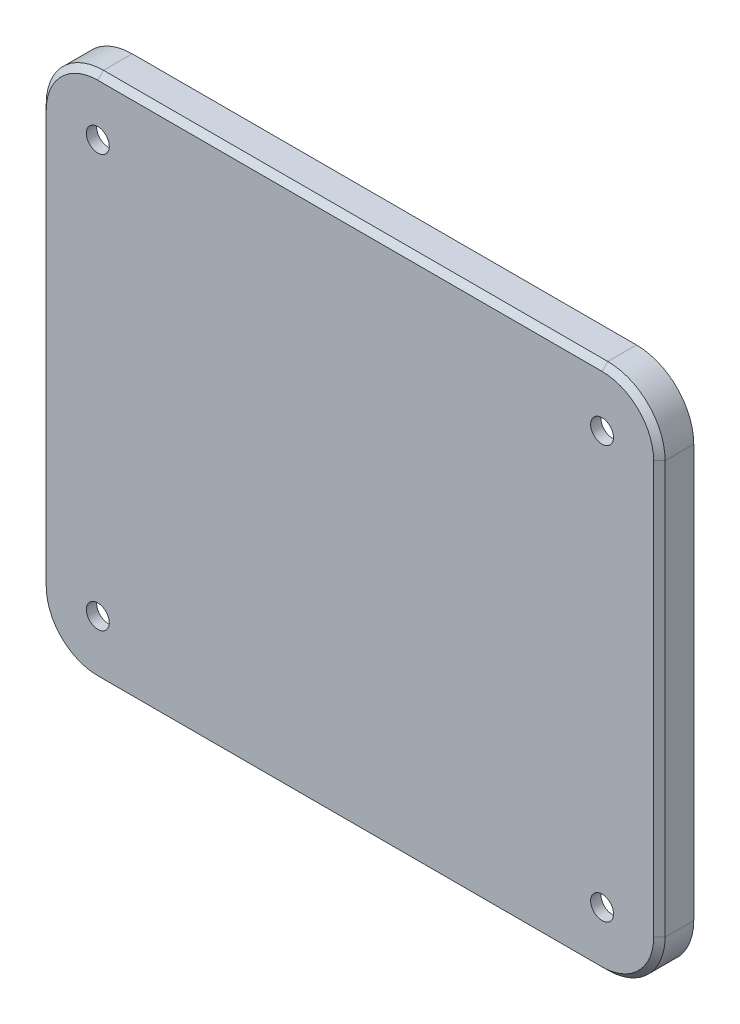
ISO-10303-21;
HEADER;
FILE_DESCRIPTION(('STEP AP214'),'2;1');
FILE_NAME('part.step','',(''),(''),'','','');
FILE_SCHEMA(('AUTOMOTIVE_DESIGN { 1 0 10303 214 1 1 1 1 }'));
ENDSEC;
DATA;
#1=APPLICATION_CONTEXT('core data for automotive mechanical design processes');
#2=APPLICATION_PROTOCOL_DEFINITION('international standard','automotive_design',2000,#1);
#3=PRODUCT_CONTEXT('',#1,'mechanical');
#4=PRODUCT('Part','Part','',(#3));
#5=PRODUCT_RELATED_PRODUCT_CATEGORY('part','',(#4));
#6=PRODUCT_DEFINITION_FORMATION('','',#4);
#7=PRODUCT_DEFINITION_CONTEXT('part definition',#1,'design');
#8=PRODUCT_DEFINITION('design','',#6,#7);
#9=PRODUCT_DEFINITION_SHAPE('','',#8);
#10=(LENGTH_UNIT() NAMED_UNIT(*) SI_UNIT(.MILLI.,.METRE.));
#11=(NAMED_UNIT(*) PLANE_ANGLE_UNIT() SI_UNIT($,.RADIAN.));
#12=(NAMED_UNIT(*) SI_UNIT($,.STERADIAN.) SOLID_ANGLE_UNIT());
#13=UNCERTAINTY_MEASURE_WITH_UNIT(LENGTH_MEASURE(1.E-05),#10,'distance_accuracy_value','');
#14=(GEOMETRIC_REPRESENTATION_CONTEXT(3) GLOBAL_UNCERTAINTY_ASSIGNED_CONTEXT((#13)) GLOBAL_UNIT_ASSIGNED_CONTEXT((#10,
#11,#12)) REPRESENTATION_CONTEXT('',''));
#15=CARTESIAN_POINT('',(0.,0.,0.));
#16=DIRECTION('',(0.,0.,1.));
#17=DIRECTION('',(1.,0.,0.));
#18=AXIS2_PLACEMENT_3D('',#15,#16,#17);
#19=CARTESIAN_POINT('',(-44.0000000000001,-36.,6.));
#20=DIRECTION('',(0.,0.,1.));
#21=DIRECTION('',(1.,0.,0.));
#22=AXIS2_PLACEMENT_3D('',#19,#20,#21);
#23=PLANE('',#22);
#24=CARTESIAN_POINT('',(-44.0000000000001,36.,6.));
#25=DIRECTION('',(0.,0.,1.));
#26=DIRECTION('',(1.,0.,0.));
#27=AXIS2_PLACEMENT_3D('',#24,#25,#26);
#28=CIRCLE('',#27,9.);
#29=CARTESIAN_POINT('',(-44.0000000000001,45.,6.));
#30=VERTEX_POINT('',#29);
#31=CARTESIAN_POINT('',(-53.0000000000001,36.,6.));
#32=VERTEX_POINT('',#31);
#33=EDGE_CURVE('E357',#30,#32,#28,.T.);
#34=ORIENTED_EDGE('',*,*,#33,.T.);
#35=DIRECTION('',(0.,-1.,0.));
#36=VECTOR('',#35,1.);
#37=CARTESIAN_POINT('',(-53.0000000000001,-36.,6.));
#38=LINE('',#37,#36);
#39=CARTESIAN_POINT('',(-53.0000000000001,-36.,6.));
#40=VERTEX_POINT('',#39);
#41=EDGE_CURVE('E361',#32,#40,#38,.T.);
#42=ORIENTED_EDGE('',*,*,#41,.T.);
#43=CARTESIAN_POINT('',(-44.0000000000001,-36.,6.));
#44=DIRECTION('',(0.,0.,1.));
#45=DIRECTION('',(1.,0.,0.));
#46=AXIS2_PLACEMENT_3D('',#43,#44,#45);
#47=CIRCLE('',#46,9.);
#48=CARTESIAN_POINT('',(-44.0000000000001,-45.,6.));
#49=VERTEX_POINT('',#48);
#50=EDGE_CURVE('E359',#40,#49,#47,.T.);
#51=ORIENTED_EDGE('',*,*,#50,.T.);
#52=DIRECTION('',(1.,0.,0.));
#53=VECTOR('',#52,1.);
#54=CARTESIAN_POINT('',(44.0000000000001,-45.,6.));
#55=LINE('',#54,#53);
#56=CARTESIAN_POINT('',(44.0000000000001,-45.,6.));
#57=VERTEX_POINT('',#56);
#58=EDGE_CURVE('E355',#49,#57,#55,.T.);
#59=ORIENTED_EDGE('',*,*,#58,.T.);
#60=CARTESIAN_POINT('',(44.0000000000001,-36.,6.));
#61=DIRECTION('',(0.,0.,1.));
#62=DIRECTION('',(1.,0.,0.));
#63=AXIS2_PLACEMENT_3D('',#60,#61,#62);
#64=CIRCLE('',#63,9.);
#65=CARTESIAN_POINT('',(53.0000000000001,-36.,6.));
#66=VERTEX_POINT('',#65);
#67=EDGE_CURVE('E351',#57,#66,#64,.T.);
#68=ORIENTED_EDGE('',*,*,#67,.T.);
#69=DIRECTION('',(0.,1.,0.));
#70=VECTOR('',#69,1.);
#71=CARTESIAN_POINT('',(53.0000000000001,36.,6.));
#72=LINE('',#71,#70);
#73=CARTESIAN_POINT('',(53.0000000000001,36.,6.));
#74=VERTEX_POINT('',#73);
#75=EDGE_CURVE('E324',#66,#74,#72,.T.);
#76=ORIENTED_EDGE('',*,*,#75,.T.);
#77=CARTESIAN_POINT('',(44.0000000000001,36.,6.));
#78=DIRECTION('',(0.,0.,1.));
#79=DIRECTION('',(1.,0.,0.));
#80=AXIS2_PLACEMENT_3D('',#77,#78,#79);
#81=CIRCLE('',#80,9.);
#82=CARTESIAN_POINT('',(44.0000000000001,45.,6.));
#83=VERTEX_POINT('',#82);
#84=EDGE_CURVE('E349',#74,#83,#81,.T.);
#85=ORIENTED_EDGE('',*,*,#84,.T.);
#86=DIRECTION('',(-1.,0.,0.));
#87=VECTOR('',#86,1.);
#88=CARTESIAN_POINT('',(-44.0000000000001,45.,6.));
#89=LINE('',#88,#87);
#90=EDGE_CURVE('E353',#83,#30,#89,.T.);
#91=ORIENTED_EDGE('',*,*,#90,.T.);
#92=EDGE_LOOP('',(#34,#42,#51,#59,#68,#76,#85,#91));
#93=FACE_BOUND('',#92,.T.);
#94=CARTESIAN_POINT('',(43.9999999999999,36.,6.));
#95=DIRECTION('',(0.,0.,1.));
#96=DIRECTION('',(1.,0.,0.));
#97=AXIS2_PLACEMENT_3D('',#94,#95,#96);
#98=CIRCLE('',#97,2.);
#99=CARTESIAN_POINT('',(45.9999999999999,36.,6.));
#100=VERTEX_POINT('',#99);
#101=EDGE_CURVE('E242',#100,#100,#98,.T.);
#102=ORIENTED_EDGE('',*,*,#101,.F.);
#103=EDGE_LOOP('',(#102));
#104=FACE_BOUND('',#103,.T.);
#105=CARTESIAN_POINT('',(-43.9999999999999,-36.,6.));
#106=DIRECTION('',(0.,0.,1.));
#107=DIRECTION('',(1.,0.,0.));
#108=AXIS2_PLACEMENT_3D('',#105,#106,#107);
#109=CIRCLE('',#108,2.);
#110=CARTESIAN_POINT('',(-41.9999999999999,-36.,6.));
#111=VERTEX_POINT('',#110);
#112=EDGE_CURVE('E248',#111,#111,#109,.T.);
#113=ORIENTED_EDGE('',*,*,#112,.F.);
#114=EDGE_LOOP('',(#113));
#115=FACE_BOUND('',#114,.T.);
#116=CARTESIAN_POINT('',(44.0000000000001,-36.,6.));
#117=DIRECTION('',(0.,0.,1.));
#118=DIRECTION('',(1.,0.,0.));
#119=AXIS2_PLACEMENT_3D('',#116,#117,#118);
#120=CIRCLE('',#119,2.);
#121=CARTESIAN_POINT('',(46.0000000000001,-36.,6.));
#122=VERTEX_POINT('',#121);
#123=EDGE_CURVE('E245',#122,#122,#120,.T.);
#124=ORIENTED_EDGE('',*,*,#123,.F.);
#125=EDGE_LOOP('',(#124));
#126=FACE_BOUND('',#125,.T.);
#127=CARTESIAN_POINT('',(-44.0000000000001,36.,6.));
#128=DIRECTION('',(0.,0.,1.));
#129=DIRECTION('',(1.,0.,0.));
#130=AXIS2_PLACEMENT_3D('',#127,#128,#129);
#131=CIRCLE('',#130,2.);
#132=CARTESIAN_POINT('',(-42.0000000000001,36.,6.));
#133=VERTEX_POINT('',#132);
#134=EDGE_CURVE('E239',#133,#133,#131,.T.);
#135=ORIENTED_EDGE('',*,*,#134,.F.);
#136=EDGE_LOOP('',(#135));
#137=FACE_BOUND('',#136,.T.);
#138=ADVANCED_FACE('F33',(#93,#104,#115,#126,#137),#23,.T.);
#139=CARTESIAN_POINT('',(-44.0000000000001,-36.,0.));
#140=DIRECTION('',(0.,0.,1.));
#141=DIRECTION('',(1.,0.,0.));
#142=AXIS2_PLACEMENT_3D('',#139,#140,#141);
#143=PLANE('',#142);
#144=DIRECTION('',(0.,-1.,0.));
#145=VECTOR('',#144,1.);
#146=CARTESIAN_POINT('',(-52.2000000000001,-36.,0.));
#147=LINE('',#146,#145);
#148=CARTESIAN_POINT('',(-52.2000000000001,36.,0.));
#149=VERTEX_POINT('',#148);
#150=CARTESIAN_POINT('',(-52.2000000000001,-36.,0.));
#151=VERTEX_POINT('',#150);
#152=EDGE_CURVE('E199',#149,#151,#147,.T.);
#153=ORIENTED_EDGE('',*,*,#152,.T.);
#154=CARTESIAN_POINT('',(-44.0000000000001,-36.,0.));
#155=DIRECTION('',(0.,0.,1.));
#156=DIRECTION('',(1.,0.,0.));
#157=AXIS2_PLACEMENT_3D('',#154,#155,#156);
#158=CIRCLE('',#157,8.20000000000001);
#159=CARTESIAN_POINT('',(-44.0000000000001,-44.2,0.));
#160=VERTEX_POINT('',#159);
#161=EDGE_CURVE('E208',#151,#160,#158,.T.);
#162=ORIENTED_EDGE('',*,*,#161,.T.);
#163=DIRECTION('',(1.,0.,0.));
#164=VECTOR('',#163,1.);
#165=CARTESIAN_POINT('',(44.0000000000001,-44.2,0.));
#166=LINE('',#165,#164);
#167=CARTESIAN_POINT('',(44.0000000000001,-44.2,0.));
#168=VERTEX_POINT('',#167);
#169=EDGE_CURVE('E215',#160,#168,#166,.T.);
#170=ORIENTED_EDGE('',*,*,#169,.T.);
#171=CARTESIAN_POINT('',(44.0000000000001,-36.,0.));
#172=DIRECTION('',(0.,0.,1.));
#173=DIRECTION('',(1.,0.,0.));
#174=AXIS2_PLACEMENT_3D('',#171,#172,#173);
#175=CIRCLE('',#174,8.2);
#176=CARTESIAN_POINT('',(52.2000000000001,-36.,0.));
#177=VERTEX_POINT('',#176);
#178=EDGE_CURVE('E235',#168,#177,#175,.T.);
#179=ORIENTED_EDGE('',*,*,#178,.T.);
#180=DIRECTION('',(0.,1.,0.));
#181=VECTOR('',#180,1.);
#182=CARTESIAN_POINT('',(52.2000000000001,-36.,0.));
#183=LINE('',#182,#181);
#184=CARTESIAN_POINT('',(52.2000000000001,36.,0.));
#185=VERTEX_POINT('',#184);
#186=EDGE_CURVE('E232',#177,#185,#183,.T.);
#187=ORIENTED_EDGE('',*,*,#186,.T.);
#188=CARTESIAN_POINT('',(44.0000000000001,36.,0.));
#189=DIRECTION('',(0.,0.,1.));
#190=DIRECTION('',(1.,0.,0.));
#191=AXIS2_PLACEMENT_3D('',#188,#189,#190);
#192=CIRCLE('',#191,8.2);
#193=CARTESIAN_POINT('',(44.0000000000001,44.2,0.));
#194=VERTEX_POINT('',#193);
#195=EDGE_CURVE('E229',#185,#194,#192,.T.);
#196=ORIENTED_EDGE('',*,*,#195,.T.);
#197=DIRECTION('',(-1.,0.,0.));
#198=VECTOR('',#197,1.);
#199=CARTESIAN_POINT('',(44.0000000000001,44.2,0.));
#200=LINE('',#199,#198);
#201=CARTESIAN_POINT('',(-44.0000000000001,44.2,0.));
#202=VERTEX_POINT('',#201);
#203=EDGE_CURVE('E224',#194,#202,#200,.T.);
#204=ORIENTED_EDGE('',*,*,#203,.T.);
#205=CARTESIAN_POINT('',(-44.0000000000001,36.,0.));
#206=DIRECTION('',(0.,0.,1.));
#207=DIRECTION('',(1.,0.,0.));
#208=AXIS2_PLACEMENT_3D('',#205,#206,#207);
#209=CIRCLE('',#208,8.2);
#210=EDGE_CURVE('E222',#202,#149,#209,.T.);
#211=ORIENTED_EDGE('',*,*,#210,.T.);
#212=EDGE_LOOP('',(#153,#162,#170,#179,#187,#196,#204,#211));
#213=FACE_BOUND('',#212,.T.);
#214=CARTESIAN_POINT('',(-44.0000000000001,-36.,0.));
#215=DIRECTION('',(0.,0.,1.));
#216=DIRECTION('',(1.,0.,0.));
#217=AXIS2_PLACEMENT_3D('',#214,#215,#216);
#218=CIRCLE('',#217,10.);
#219=CARTESIAN_POINT('',(-54.0000000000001,-36.,0.));
#220=VERTEX_POINT('',#219);
#221=CARTESIAN_POINT('',(-44.0000000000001,-46.,0.));
#222=VERTEX_POINT('',#221);
#223=EDGE_CURVE('E251',#220,#222,#218,.T.);
#224=ORIENTED_EDGE('',*,*,#223,.F.);
#225=DIRECTION('',(0.,-1.,0.));
#226=VECTOR('',#225,1.);
#227=CARTESIAN_POINT('',(-54.0000000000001,-36.,0.));
#228=LINE('',#227,#226);
#229=CARTESIAN_POINT('',(-54.0000000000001,36.,0.));
#230=VERTEX_POINT('',#229);
#231=EDGE_CURVE('E272',#230,#220,#228,.T.);
#232=ORIENTED_EDGE('',*,*,#231,.F.);
#233=CARTESIAN_POINT('',(-44.0000000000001,36.,0.));
#234=DIRECTION('',(0.,0.,1.));
#235=DIRECTION('',(1.,0.,0.));
#236=AXIS2_PLACEMENT_3D('',#233,#234,#235);
#237=CIRCLE('',#236,10.);
#238=CARTESIAN_POINT('',(-44.0000000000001,46.,0.));
#239=VERTEX_POINT('',#238);
#240=EDGE_CURVE('E269',#239,#230,#237,.T.);
#241=ORIENTED_EDGE('',*,*,#240,.F.);
#242=DIRECTION('',(-1.,0.,0.));
#243=VECTOR('',#242,1.);
#244=CARTESIAN_POINT('',(44.0000000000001,46.,0.));
#245=LINE('',#244,#243);
#246=CARTESIAN_POINT('',(44.0000000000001,46.,0.));
#247=VERTEX_POINT('',#246);
#248=EDGE_CURVE('E266',#247,#239,#245,.T.);
#249=ORIENTED_EDGE('',*,*,#248,.F.);
#250=CARTESIAN_POINT('',(44.0000000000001,36.,0.));
#251=DIRECTION('',(0.,0.,1.));
#252=DIRECTION('',(1.,0.,0.));
#253=AXIS2_PLACEMENT_3D('',#250,#251,#252);
#254=CIRCLE('',#253,10.);
#255=CARTESIAN_POINT('',(54.0000000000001,36.,0.));
#256=VERTEX_POINT('',#255);
#257=EDGE_CURVE('E263',#256,#247,#254,.T.);
#258=ORIENTED_EDGE('',*,*,#257,.F.);
#259=DIRECTION('',(0.,1.,0.));
#260=VECTOR('',#259,1.);
#261=CARTESIAN_POINT('',(54.0000000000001,-36.,0.));
#262=LINE('',#261,#260);
#263=CARTESIAN_POINT('',(54.0000000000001,-36.,0.));
#264=VERTEX_POINT('',#263);
#265=EDGE_CURVE('E260',#264,#256,#262,.T.);
#266=ORIENTED_EDGE('',*,*,#265,.F.);
#267=CARTESIAN_POINT('',(44.0000000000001,-36.,0.));
#268=DIRECTION('',(0.,0.,1.));
#269=DIRECTION('',(1.,0.,0.));
#270=AXIS2_PLACEMENT_3D('',#267,#268,#269);
#271=CIRCLE('',#270,10.);
#272=CARTESIAN_POINT('',(44.0000000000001,-46.,0.));
#273=VERTEX_POINT('',#272);
#274=EDGE_CURVE('E257',#273,#264,#271,.T.);
#275=ORIENTED_EDGE('',*,*,#274,.F.);
#276=DIRECTION('',(1.,0.,0.));
#277=VECTOR('',#276,1.);
#278=CARTESIAN_POINT('',(44.0000000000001,-46.,0.));
#279=LINE('',#278,#277);
#280=EDGE_CURVE('E254',#222,#273,#279,.T.);
#281=ORIENTED_EDGE('',*,*,#280,.F.);
#282=EDGE_LOOP('',(#224,#232,#241,#249,#258,#266,#275,#281));
#283=FACE_BOUND('',#282,.T.);
#284=ADVANCED_FACE('F218',(#213,#283),#143,.F.);
#285=CARTESIAN_POINT('',(-44.0000000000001,-36.,6.));
#286=DIRECTION('',(0.,0.,-1.));
#287=DIRECTION('',(-1.,0.,0.));
#288=AXIS2_PLACEMENT_3D('',#285,#286,#287);
#289=CYLINDRICAL_SURFACE('',#288,10.);
#290=DIRECTION('',(0.,0.,-1.));
#291=VECTOR('',#290,1.);
#292=CARTESIAN_POINT('',(-44.0000000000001,-46.,6.));
#293=LINE('',#292,#291);
#294=CARTESIAN_POINT('',(-44.0000000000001,-46.,5.));
#295=VERTEX_POINT('',#294);
#296=EDGE_CURVE('E289',#295,#222,#293,.T.);
#297=ORIENTED_EDGE('',*,*,#296,.F.);
#298=CARTESIAN_POINT('',(-44.0000000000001,-36.,5.));
#299=DIRECTION('',(0.,0.,1.));
#300=DIRECTION('',(1.,0.,0.));
#301=AXIS2_PLACEMENT_3D('',#298,#299,#300);
#302=CIRCLE('',#301,10.);
#303=CARTESIAN_POINT('',(-54.0000000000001,-36.,5.));
#304=VERTEX_POINT('',#303);
#305=EDGE_CURVE('E367',#295,#304,#302,.F.);
#306=ORIENTED_EDGE('',*,*,#305,.T.);
#307=DIRECTION('',(0.,0.,-1.));
#308=VECTOR('',#307,1.);
#309=CARTESIAN_POINT('',(-54.0000000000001,-36.,6.));
#310=LINE('',#309,#308);
#311=EDGE_CURVE('E275',#304,#220,#310,.T.);
#312=ORIENTED_EDGE('',*,*,#311,.T.);
#313=ORIENTED_EDGE('',*,*,#223,.T.);
#314=EDGE_LOOP('',(#297,#306,#312,#313));
#315=FACE_BOUND('',#314,.T.);
#316=ADVANCED_FACE('F453',(#315),#289,.T.);
#317=CARTESIAN_POINT('',(44.0000000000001,-46.,6.));
#318=DIRECTION('',(0.,1.,0.));
#319=DIRECTION('',(0.,0.,1.));
#320=AXIS2_PLACEMENT_3D('',#317,#318,#319);
#321=PLANE('',#320);
#322=DIRECTION('',(0.,0.,-1.));
#323=VECTOR('',#322,1.);
#324=CARTESIAN_POINT('',(44.0000000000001,-46.,6.));
#325=LINE('',#324,#323);
#326=CARTESIAN_POINT('',(44.0000000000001,-46.,5.));
#327=VERTEX_POINT('',#326);
#328=EDGE_CURVE('E287',#327,#273,#325,.T.);
#329=ORIENTED_EDGE('',*,*,#328,.F.);
#330=DIRECTION('',(-1.,0.,0.));
#331=VECTOR('',#330,1.);
#332=CARTESIAN_POINT('',(-44.0000000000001,-46.,5.));
#333=LINE('',#332,#331);
#334=EDGE_CURVE('E371',#327,#295,#333,.T.);
#335=ORIENTED_EDGE('',*,*,#334,.T.);
#336=ORIENTED_EDGE('',*,*,#296,.T.);
#337=ORIENTED_EDGE('',*,*,#280,.T.);
#338=EDGE_LOOP('',(#329,#335,#336,#337));
#339=FACE_BOUND('',#338,.T.);
#340=ADVANCED_FACE('F414',(#339),#321,.F.);
#341=CARTESIAN_POINT('',(44.0000000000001,-36.,6.));
#342=DIRECTION('',(0.,0.,-1.));
#343=DIRECTION('',(-1.,0.,0.));
#344=AXIS2_PLACEMENT_3D('',#341,#342,#343);
#345=CYLINDRICAL_SURFACE('',#344,10.);
#346=DIRECTION('',(0.,0.,-1.));
#347=VECTOR('',#346,1.);
#348=CARTESIAN_POINT('',(54.0000000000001,-36.,6.));
#349=LINE('',#348,#347);
#350=CARTESIAN_POINT('',(54.0000000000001,-36.,5.));
#351=VERTEX_POINT('',#350);
#352=EDGE_CURVE('E285',#351,#264,#349,.T.);
#353=ORIENTED_EDGE('',*,*,#352,.F.);
#354=CARTESIAN_POINT('',(44.0000000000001,-36.,5.));
#355=DIRECTION('',(0.,0.,1.));
#356=DIRECTION('',(1.,0.,0.));
#357=AXIS2_PLACEMENT_3D('',#354,#355,#356);
#358=CIRCLE('',#357,10.);
#359=EDGE_CURVE('E375',#351,#327,#358,.F.);
#360=ORIENTED_EDGE('',*,*,#359,.T.);
#361=ORIENTED_EDGE('',*,*,#328,.T.);
#362=ORIENTED_EDGE('',*,*,#274,.T.);
#363=EDGE_LOOP('',(#353,#360,#361,#362));
#364=FACE_BOUND('',#363,.T.);
#365=ADVANCED_FACE('F412',(#364),#345,.T.);
#366=CARTESIAN_POINT('',(54.0000000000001,-36.,6.));
#367=DIRECTION('',(-1.,0.,0.));
#368=DIRECTION('',(0.,0.,1.));
#369=AXIS2_PLACEMENT_3D('',#366,#367,#368);
#370=PLANE('',#369);
#371=DIRECTION('',(0.,0.,-1.));
#372=VECTOR('',#371,1.);
#373=CARTESIAN_POINT('',(54.0000000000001,36.,6.));
#374=LINE('',#373,#372);
#375=CARTESIAN_POINT('',(54.0000000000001,36.,5.));
#376=VERTEX_POINT('',#375);
#377=EDGE_CURVE('E283',#376,#256,#374,.T.);
#378=ORIENTED_EDGE('',*,*,#377,.F.);
#379=DIRECTION('',(0.,-1.,0.));
#380=VECTOR('',#379,1.);
#381=CARTESIAN_POINT('',(54.0000000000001,-36.,5.));
#382=LINE('',#381,#380);
#383=EDGE_CURVE('E11',#376,#351,#382,.T.);
#384=ORIENTED_EDGE('',*,*,#383,.T.);
#385=ORIENTED_EDGE('',*,*,#352,.T.);
#386=ORIENTED_EDGE('',*,*,#265,.T.);
#387=EDGE_LOOP('',(#378,#384,#385,#386));
#388=FACE_BOUND('',#387,.T.);
#389=ADVANCED_FACE('F422',(#388),#370,.F.);
#390=CARTESIAN_POINT('',(44.0000000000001,36.,6.));
#391=DIRECTION('',(0.,0.,-1.));
#392=DIRECTION('',(-1.,0.,0.));
#393=AXIS2_PLACEMENT_3D('',#390,#391,#392);
#394=CYLINDRICAL_SURFACE('',#393,10.);
#395=DIRECTION('',(0.,0.,-1.));
#396=VECTOR('',#395,1.);
#397=CARTESIAN_POINT('',(44.0000000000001,46.,6.));
#398=LINE('',#397,#396);
#399=CARTESIAN_POINT('',(44.0000000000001,46.,5.));
#400=VERTEX_POINT('',#399);
#401=EDGE_CURVE('E281',#400,#247,#398,.T.);
#402=ORIENTED_EDGE('',*,*,#401,.F.);
#403=CARTESIAN_POINT('',(44.0000000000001,36.,5.));
#404=DIRECTION('',(0.,0.,1.));
#405=DIRECTION('',(1.,0.,0.));
#406=AXIS2_PLACEMENT_3D('',#403,#404,#405);
#407=CIRCLE('',#406,10.);
#408=EDGE_CURVE('E42',#400,#376,#407,.F.);
#409=ORIENTED_EDGE('',*,*,#408,.T.);
#410=ORIENTED_EDGE('',*,*,#377,.T.);
#411=ORIENTED_EDGE('',*,*,#257,.T.);
#412=EDGE_LOOP('',(#402,#409,#410,#411));
#413=FACE_BOUND('',#412,.T.);
#414=ADVANCED_FACE('F423',(#413),#394,.T.);
#415=CARTESIAN_POINT('',(44.0000000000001,46.,6.));
#416=DIRECTION('',(0.,-1.,0.));
#417=DIRECTION('',(0.,0.,-1.));
#418=AXIS2_PLACEMENT_3D('',#415,#416,#417);
#419=PLANE('',#418);
#420=DIRECTION('',(0.,0.,-1.));
#421=VECTOR('',#420,1.);
#422=CARTESIAN_POINT('',(-44.0000000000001,46.,6.));
#423=LINE('',#422,#421);
#424=CARTESIAN_POINT('',(-44.0000000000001,46.,5.));
#425=VERTEX_POINT('',#424);
#426=EDGE_CURVE('E279',#425,#239,#423,.T.);
#427=ORIENTED_EDGE('',*,*,#426,.F.);
#428=DIRECTION('',(1.,0.,0.));
#429=VECTOR('',#428,1.);
#430=CARTESIAN_POINT('',(44.0000000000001,46.,5.));
#431=LINE('',#430,#429);
#432=EDGE_CURVE('E373',#425,#400,#431,.T.);
#433=ORIENTED_EDGE('',*,*,#432,.T.);
#434=ORIENTED_EDGE('',*,*,#401,.T.);
#435=ORIENTED_EDGE('',*,*,#248,.T.);
#436=EDGE_LOOP('',(#427,#433,#434,#435));
#437=FACE_BOUND('',#436,.T.);
#438=ADVANCED_FACE('F428',(#437),#419,.F.);
#439=CARTESIAN_POINT('',(-44.0000000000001,36.,6.));
#440=DIRECTION('',(0.,0.,-1.));
#441=DIRECTION('',(-1.,0.,0.));
#442=AXIS2_PLACEMENT_3D('',#439,#440,#441);
#443=CYLINDRICAL_SURFACE('',#442,10.);
#444=DIRECTION('',(0.,0.,-1.));
#445=VECTOR('',#444,1.);
#446=CARTESIAN_POINT('',(-54.0000000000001,36.,6.));
#447=LINE('',#446,#445);
#448=CARTESIAN_POINT('',(-54.0000000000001,36.,5.));
#449=VERTEX_POINT('',#448);
#450=EDGE_CURVE('E277',#449,#230,#447,.T.);
#451=ORIENTED_EDGE('',*,*,#450,.F.);
#452=CARTESIAN_POINT('',(-44.0000000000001,36.,5.));
#453=DIRECTION('',(0.,0.,1.));
#454=DIRECTION('',(1.,0.,0.));
#455=AXIS2_PLACEMENT_3D('',#452,#453,#454);
#456=CIRCLE('',#455,10.);
#457=EDGE_CURVE('E369',#449,#425,#456,.F.);
#458=ORIENTED_EDGE('',*,*,#457,.T.);
#459=ORIENTED_EDGE('',*,*,#426,.T.);
#460=ORIENTED_EDGE('',*,*,#240,.T.);
#461=EDGE_LOOP('',(#451,#458,#459,#460));
#462=FACE_BOUND('',#461,.T.);
#463=ADVANCED_FACE('F481',(#462),#443,.T.);
#464=CARTESIAN_POINT('',(-54.0000000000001,-36.,6.));
#465=DIRECTION('',(1.,0.,0.));
#466=DIRECTION('',(0.,1.,0.));
#467=AXIS2_PLACEMENT_3D('',#464,#465,#466);
#468=PLANE('',#467);
#469=ORIENTED_EDGE('',*,*,#311,.F.);
#470=DIRECTION('',(0.,1.,0.));
#471=VECTOR('',#470,1.);
#472=CARTESIAN_POINT('',(-54.0000000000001,36.,5.));
#473=LINE('',#472,#471);
#474=EDGE_CURVE('E364',#304,#449,#473,.T.);
#475=ORIENTED_EDGE('',*,*,#474,.T.);
#476=ORIENTED_EDGE('',*,*,#450,.T.);
#477=ORIENTED_EDGE('',*,*,#231,.T.);
#478=EDGE_LOOP('',(#469,#475,#476,#477));
#479=FACE_BOUND('',#478,.T.);
#480=ADVANCED_FACE('F456',(#479),#468,.F.);
#481=CARTESIAN_POINT('',(-43.9999999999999,-36.,6.));
#482=DIRECTION('',(0.,0.,-1.));
#483=DIRECTION('',(-1.,0.,0.));
#484=AXIS2_PLACEMENT_3D('',#481,#482,#483);
#485=CYLINDRICAL_SURFACE('',#484,2.);
#486=CARTESIAN_POINT('',(-43.9999999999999,-36.,4.2));
#487=DIRECTION('',(0.,0.,1.));
#488=DIRECTION('',(1.,0.,0.));
#489=AXIS2_PLACEMENT_3D('',#486,#487,#488);
#490=CIRCLE('',#489,2.);
#491=CARTESIAN_POINT('',(-41.9999999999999,-36.,4.2));
#492=VERTEX_POINT('',#491);
#493=EDGE_CURVE('E216',#492,#492,#490,.T.);
#494=ORIENTED_EDGE('',*,*,#493,.F.);
#495=EDGE_LOOP('',(#494));
#496=FACE_BOUND('',#495,.T.);
#497=ORIENTED_EDGE('',*,*,#112,.T.);
#498=EDGE_LOOP('',(#497));
#499=FACE_BOUND('',#498,.T.);
#500=ADVANCED_FACE('F476',(#496,#499),#485,.F.);
#501=CARTESIAN_POINT('',(44.0000000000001,-36.,6.));
#502=DIRECTION('',(0.,0.,-1.));
#503=DIRECTION('',(-1.,0.,0.));
#504=AXIS2_PLACEMENT_3D('',#501,#502,#503);
#505=CYLINDRICAL_SURFACE('',#504,2.);
#506=CARTESIAN_POINT('',(44.0000000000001,-36.,4.2));
#507=DIRECTION('',(0.,0.,1.));
#508=DIRECTION('',(1.,0.,0.));
#509=AXIS2_PLACEMENT_3D('',#506,#507,#508);
#510=CIRCLE('',#509,2.);
#511=CARTESIAN_POINT('',(46.0000000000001,-36.,4.2));
#512=VERTEX_POINT('',#511);
#513=EDGE_CURVE('E572',#512,#512,#510,.T.);
#514=ORIENTED_EDGE('',*,*,#513,.F.);
#515=EDGE_LOOP('',(#514));
#516=FACE_BOUND('',#515,.T.);
#517=ORIENTED_EDGE('',*,*,#123,.T.);
#518=EDGE_LOOP('',(#517));
#519=FACE_BOUND('',#518,.T.);
#520=ADVANCED_FACE('F592',(#516,#519),#505,.F.);
#521=CARTESIAN_POINT('',(43.9999999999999,36.,6.));
#522=DIRECTION('',(0.,0.,-1.));
#523=DIRECTION('',(-1.,0.,0.));
#524=AXIS2_PLACEMENT_3D('',#521,#522,#523);
#525=CYLINDRICAL_SURFACE('',#524,2.);
#526=CARTESIAN_POINT('',(43.9999999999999,36.,4.2));
#527=DIRECTION('',(0.,0.,1.));
#528=DIRECTION('',(1.,0.,0.));
#529=AXIS2_PLACEMENT_3D('',#526,#527,#528);
#530=CIRCLE('',#529,2.);
#531=CARTESIAN_POINT('',(45.9999999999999,36.,4.2));
#532=VERTEX_POINT('',#531);
#533=EDGE_CURVE('E569',#532,#532,#530,.T.);
#534=ORIENTED_EDGE('',*,*,#533,.F.);
#535=EDGE_LOOP('',(#534));
#536=FACE_BOUND('',#535,.T.);
#537=ORIENTED_EDGE('',*,*,#101,.T.);
#538=EDGE_LOOP('',(#537));
#539=FACE_BOUND('',#538,.T.);
#540=ADVANCED_FACE('F583',(#536,#539),#525,.F.);
#541=CARTESIAN_POINT('',(-44.0000000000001,36.,6.));
#542=DIRECTION('',(0.,0.,-1.));
#543=DIRECTION('',(-1.,0.,0.));
#544=AXIS2_PLACEMENT_3D('',#541,#542,#543);
#545=CYLINDRICAL_SURFACE('',#544,2.);
#546=CARTESIAN_POINT('',(-44.0000000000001,36.,4.2));
#547=DIRECTION('',(0.,0.,1.));
#548=DIRECTION('',(1.,0.,0.));
#549=AXIS2_PLACEMENT_3D('',#546,#547,#548);
#550=CIRCLE('',#549,2.);
#551=CARTESIAN_POINT('',(-42.0000000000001,36.,4.2));
#552=VERTEX_POINT('',#551);
#553=EDGE_CURVE('E347',#552,#552,#550,.T.);
#554=ORIENTED_EDGE('',*,*,#553,.F.);
#555=EDGE_LOOP('',(#554));
#556=FACE_BOUND('',#555,.T.);
#557=ORIENTED_EDGE('',*,*,#134,.T.);
#558=EDGE_LOOP('',(#557));
#559=FACE_BOUND('',#558,.T.);
#560=ADVANCED_FACE('F580',(#556,#559),#545,.F.);
#561=CARTESIAN_POINT('',(-44.0000000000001,-36.,4.2));
#562=DIRECTION('',(0.,0.,1.));
#563=DIRECTION('',(1.,0.,0.));
#564=AXIS2_PLACEMENT_3D('',#561,#562,#563);
#565=PLANE('',#564);
#566=DIRECTION('',(0.,-1.,0.));
#567=VECTOR('',#566,1.);
#568=CARTESIAN_POINT('',(-50.4000000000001,-36.,4.2));
#569=LINE('',#568,#567);
#570=CARTESIAN_POINT('',(-50.4000000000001,-36.,4.2));
#571=VERTEX_POINT('',#570);
#572=CARTESIAN_POINT('',(-50.4000000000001,36.,4.2));
#573=VERTEX_POINT('',#572);
#574=EDGE_CURVE('E294',#571,#573,#569,.F.);
#575=ORIENTED_EDGE('',*,*,#574,.T.);
#576=CARTESIAN_POINT('',(-44.0000000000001,36.,4.2));
#577=DIRECTION('',(0.,0.,1.));
#578=DIRECTION('',(1.,0.,0.));
#579=AXIS2_PLACEMENT_3D('',#576,#577,#578);
#580=CIRCLE('',#579,6.4);
#581=CARTESIAN_POINT('',(-44.0000000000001,42.4,4.2));
#582=VERTEX_POINT('',#581);
#583=EDGE_CURVE('E308',#573,#582,#580,.F.);
#584=ORIENTED_EDGE('',*,*,#583,.T.);
#585=DIRECTION('',(-1.,0.,0.));
#586=VECTOR('',#585,1.);
#587=CARTESIAN_POINT('',(-44.0000000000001,42.4,4.2));
#588=LINE('',#587,#586);
#589=CARTESIAN_POINT('',(44.0000000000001,42.4,4.2));
#590=VERTEX_POINT('',#589);
#591=EDGE_CURVE('E306',#582,#590,#588,.F.);
#592=ORIENTED_EDGE('',*,*,#591,.T.);
#593=CARTESIAN_POINT('',(44.0000000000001,36.,4.2));
#594=DIRECTION('',(0.,0.,1.));
#595=DIRECTION('',(1.,0.,0.));
#596=AXIS2_PLACEMENT_3D('',#593,#594,#595);
#597=CIRCLE('',#596,6.4);
#598=CARTESIAN_POINT('',(50.4000000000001,36.,4.2));
#599=VERTEX_POINT('',#598);
#600=EDGE_CURVE('E304',#590,#599,#597,.F.);
#601=ORIENTED_EDGE('',*,*,#600,.T.);
#602=DIRECTION('',(0.,1.,0.));
#603=VECTOR('',#602,1.);
#604=CARTESIAN_POINT('',(50.4000000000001,-36.,4.2));
#605=LINE('',#604,#603);
#606=CARTESIAN_POINT('',(50.4000000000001,-36.,4.2));
#607=VERTEX_POINT('',#606);
#608=EDGE_CURVE('E302',#599,#607,#605,.F.);
#609=ORIENTED_EDGE('',*,*,#608,.T.);
#610=CARTESIAN_POINT('',(44.0000000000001,-36.,4.2));
#611=DIRECTION('',(0.,0.,1.));
#612=DIRECTION('',(1.,0.,0.));
#613=AXIS2_PLACEMENT_3D('',#610,#611,#612);
#614=CIRCLE('',#613,6.4);
#615=CARTESIAN_POINT('',(44.0000000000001,-42.4,4.2));
#616=VERTEX_POINT('',#615);
#617=EDGE_CURVE('E300',#607,#616,#614,.F.);
#618=ORIENTED_EDGE('',*,*,#617,.T.);
#619=DIRECTION('',(1.,0.,0.));
#620=VECTOR('',#619,1.);
#621=CARTESIAN_POINT('',(-44.0000000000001,-42.4,4.2));
#622=LINE('',#621,#620);
#623=CARTESIAN_POINT('',(-44.0000000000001,-42.4,4.2));
#624=VERTEX_POINT('',#623);
#625=EDGE_CURVE('E298',#616,#624,#622,.F.);
#626=ORIENTED_EDGE('',*,*,#625,.T.);
#627=CARTESIAN_POINT('',(-44.0000000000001,-36.,4.2));
#628=DIRECTION('',(0.,0.,1.));
#629=DIRECTION('',(1.,0.,0.));
#630=AXIS2_PLACEMENT_3D('',#627,#628,#629);
#631=CIRCLE('',#630,6.40000000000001);
#632=EDGE_CURVE('E296',#624,#571,#631,.F.);
#633=ORIENTED_EDGE('',*,*,#632,.T.);
#634=EDGE_LOOP('',(#575,#584,#592,#601,#609,#618,#626,#633));
#635=FACE_BOUND('',#634,.T.);
#636=ORIENTED_EDGE('',*,*,#533,.T.);
#637=EDGE_LOOP('',(#636));
#638=FACE_BOUND('',#637,.T.);
#639=ORIENTED_EDGE('',*,*,#493,.T.);
#640=EDGE_LOOP('',(#639));
#641=FACE_BOUND('',#640,.T.);
#642=ORIENTED_EDGE('',*,*,#513,.T.);
#643=EDGE_LOOP('',(#642));
#644=FACE_BOUND('',#643,.T.);
#645=ORIENTED_EDGE('',*,*,#553,.T.);
#646=EDGE_LOOP('',(#645));
#647=FACE_BOUND('',#646,.T.);
#648=ADVANCED_FACE('F540',(#635,#638,#641,#644,#647),#565,.F.);
#649=CARTESIAN_POINT('',(-44.0000000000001,-36.,6.));
#650=DIRECTION('',(0.,0.,-1.));
#651=DIRECTION('',(-1.,0.,0.));
#652=AXIS2_PLACEMENT_3D('',#649,#650,#651);
#653=CYLINDRICAL_SURFACE('',#652,8.20000000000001);
#654=DIRECTION('',(0.,0.,-1.));
#655=VECTOR('',#654,1.);
#656=CARTESIAN_POINT('',(-52.2000000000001,-36.,6.));
#657=LINE('',#656,#655);
#658=CARTESIAN_POINT('',(-52.2000000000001,-36.,2.4));
#659=VERTEX_POINT('',#658);
#660=EDGE_CURVE('E194',#659,#151,#657,.T.);
#661=ORIENTED_EDGE('',*,*,#660,.F.);
#662=CARTESIAN_POINT('',(-44.0000000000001,-36.,2.4));
#663=DIRECTION('',(0.,0.,1.));
#664=DIRECTION('',(1.,0.,0.));
#665=AXIS2_PLACEMENT_3D('',#662,#663,#664);
#666=CIRCLE('',#665,8.20000000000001);
#667=CARTESIAN_POINT('',(-44.0000000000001,-44.2,2.4));
#668=VERTEX_POINT('',#667);
#669=EDGE_CURVE('E321',#659,#668,#666,.T.);
#670=ORIENTED_EDGE('',*,*,#669,.T.);
#671=DIRECTION('',(0.,0.,1.));
#672=VECTOR('',#671,1.);
#673=CARTESIAN_POINT('',(-44.0000000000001,-44.2,6.));
#674=LINE('',#673,#672);
#675=EDGE_CURVE('E211',#668,#160,#674,.F.);
#676=ORIENTED_EDGE('',*,*,#675,.T.);
#677=ORIENTED_EDGE('',*,*,#161,.F.);
#678=EDGE_LOOP('',(#661,#670,#676,#677));
#679=FACE_BOUND('',#678,.T.);
#680=ADVANCED_FACE('F209',(#679),#653,.F.);
#681=CARTESIAN_POINT('',(44.0000000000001,-44.2,6.));
#682=DIRECTION('',(0.,1.,0.));
#683=DIRECTION('',(0.,0.,1.));
#684=AXIS2_PLACEMENT_3D('',#681,#682,#683);
#685=PLANE('',#684);
#686=ORIENTED_EDGE('',*,*,#675,.F.);
#687=DIRECTION('',(1.,0.,0.));
#688=VECTOR('',#687,1.);
#689=CARTESIAN_POINT('',(44.0000000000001,-44.2,2.4));
#690=LINE('',#689,#688);
#691=CARTESIAN_POINT('',(44.0000000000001,-44.2,2.4));
#692=VERTEX_POINT('',#691);
#693=EDGE_CURVE('E319',#668,#692,#690,.T.);
#694=ORIENTED_EDGE('',*,*,#693,.T.);
#695=DIRECTION('',(0.,0.,-1.));
#696=VECTOR('',#695,1.);
#697=CARTESIAN_POINT('',(44.0000000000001,-44.2,6.));
#698=LINE('',#697,#696);
#699=EDGE_CURVE('E854',#692,#168,#698,.T.);
#700=ORIENTED_EDGE('',*,*,#699,.T.);
#701=ORIENTED_EDGE('',*,*,#169,.F.);
#702=EDGE_LOOP('',(#686,#694,#700,#701));
#703=FACE_BOUND('',#702,.T.);
#704=ADVANCED_FACE('F809',(#703),#685,.T.);
#705=CARTESIAN_POINT('',(44.0000000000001,-36.,6.));
#706=DIRECTION('',(0.,0.,-1.));
#707=DIRECTION('',(-1.,0.,0.));
#708=AXIS2_PLACEMENT_3D('',#705,#706,#707);
#709=CYLINDRICAL_SURFACE('',#708,8.2);
#710=ORIENTED_EDGE('',*,*,#699,.F.);
#711=CARTESIAN_POINT('',(44.0000000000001,-36.,2.4));
#712=DIRECTION('',(0.,0.,1.));
#713=DIRECTION('',(1.,0.,0.));
#714=AXIS2_PLACEMENT_3D('',#711,#712,#713);
#715=CIRCLE('',#714,8.2);
#716=CARTESIAN_POINT('',(52.2000000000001,-36.,2.4));
#717=VERTEX_POINT('',#716);
#718=EDGE_CURVE('E317',#692,#717,#715,.T.);
#719=ORIENTED_EDGE('',*,*,#718,.T.);
#720=DIRECTION('',(0.,0.,1.));
#721=VECTOR('',#720,1.);
#722=CARTESIAN_POINT('',(52.2000000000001,-36.,6.));
#723=LINE('',#722,#721);
#724=EDGE_CURVE('E563',#717,#177,#723,.F.);
#725=ORIENTED_EDGE('',*,*,#724,.T.);
#726=ORIENTED_EDGE('',*,*,#178,.F.);
#727=EDGE_LOOP('',(#710,#719,#725,#726));
#728=FACE_BOUND('',#727,.T.);
#729=ADVANCED_FACE('F799',(#728),#709,.F.);
#730=CARTESIAN_POINT('',(52.2000000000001,-36.,6.));
#731=DIRECTION('',(-1.,0.,0.));
#732=DIRECTION('',(0.,0.,1.));
#733=AXIS2_PLACEMENT_3D('',#730,#731,#732);
#734=PLANE('',#733);
#735=ORIENTED_EDGE('',*,*,#724,.F.);
#736=DIRECTION('',(0.,1.,0.));
#737=VECTOR('',#736,1.);
#738=CARTESIAN_POINT('',(52.2000000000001,-36.,2.4));
#739=LINE('',#738,#737);
#740=CARTESIAN_POINT('',(52.2000000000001,36.,2.4));
#741=VERTEX_POINT('',#740);
#742=EDGE_CURVE('E315',#717,#741,#739,.T.);
#743=ORIENTED_EDGE('',*,*,#742,.T.);
#744=DIRECTION('',(0.,0.,-1.));
#745=VECTOR('',#744,1.);
#746=CARTESIAN_POINT('',(52.2000000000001,36.,6.));
#747=LINE('',#746,#745);
#748=EDGE_CURVE('E557',#741,#185,#747,.T.);
#749=ORIENTED_EDGE('',*,*,#748,.T.);
#750=ORIENTED_EDGE('',*,*,#186,.F.);
#751=EDGE_LOOP('',(#735,#743,#749,#750));
#752=FACE_BOUND('',#751,.T.);
#753=ADVANCED_FACE('F790',(#752),#734,.T.);
#754=CARTESIAN_POINT('',(44.0000000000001,36.,6.));
#755=DIRECTION('',(0.,0.,-1.));
#756=DIRECTION('',(-1.,0.,0.));
#757=AXIS2_PLACEMENT_3D('',#754,#755,#756);
#758=CYLINDRICAL_SURFACE('',#757,8.2);
#759=ORIENTED_EDGE('',*,*,#748,.F.);
#760=CARTESIAN_POINT('',(44.0000000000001,36.,2.4));
#761=DIRECTION('',(0.,0.,1.));
#762=DIRECTION('',(1.,0.,0.));
#763=AXIS2_PLACEMENT_3D('',#760,#761,#762);
#764=CIRCLE('',#763,8.2);
#765=CARTESIAN_POINT('',(44.0000000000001,44.2,2.4));
#766=VERTEX_POINT('',#765);
#767=EDGE_CURVE('E313',#741,#766,#764,.T.);
#768=ORIENTED_EDGE('',*,*,#767,.T.);
#769=DIRECTION('',(0.,0.,-1.));
#770=VECTOR('',#769,1.);
#771=CARTESIAN_POINT('',(44.0000000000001,44.2,6.));
#772=LINE('',#771,#770);
#773=EDGE_CURVE('E555',#766,#194,#772,.T.);
#774=ORIENTED_EDGE('',*,*,#773,.T.);
#775=ORIENTED_EDGE('',*,*,#195,.F.);
#776=EDGE_LOOP('',(#759,#768,#774,#775));
#777=FACE_BOUND('',#776,.T.);
#778=ADVANCED_FACE('F553',(#777),#758,.F.);
#779=CARTESIAN_POINT('',(44.0000000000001,44.2,6.));
#780=DIRECTION('',(0.,-1.,0.));
#781=DIRECTION('',(0.,0.,-1.));
#782=AXIS2_PLACEMENT_3D('',#779,#780,#781);
#783=PLANE('',#782);
#784=ORIENTED_EDGE('',*,*,#773,.F.);
#785=DIRECTION('',(-1.,0.,0.));
#786=VECTOR('',#785,1.);
#787=CARTESIAN_POINT('',(44.0000000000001,44.2,2.4));
#788=LINE('',#787,#786);
#789=CARTESIAN_POINT('',(-44.0000000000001,44.2,2.4));
#790=VERTEX_POINT('',#789);
#791=EDGE_CURVE('E311',#766,#790,#788,.T.);
#792=ORIENTED_EDGE('',*,*,#791,.T.);
#793=DIRECTION('',(0.,0.,-1.));
#794=VECTOR('',#793,1.);
#795=CARTESIAN_POINT('',(-44.0000000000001,44.2,6.));
#796=LINE('',#795,#794);
#797=EDGE_CURVE('E561',#790,#202,#796,.T.);
#798=ORIENTED_EDGE('',*,*,#797,.T.);
#799=ORIENTED_EDGE('',*,*,#203,.F.);
#800=EDGE_LOOP('',(#784,#792,#798,#799));
#801=FACE_BOUND('',#800,.T.);
#802=ADVANCED_FACE('F559',(#801),#783,.T.);
#803=CARTESIAN_POINT('',(-44.0000000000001,36.,6.));
#804=DIRECTION('',(0.,0.,-1.));
#805=DIRECTION('',(-1.,0.,0.));
#806=AXIS2_PLACEMENT_3D('',#803,#804,#805);
#807=CYLINDRICAL_SURFACE('',#806,8.2);
#808=ORIENTED_EDGE('',*,*,#797,.F.);
#809=CARTESIAN_POINT('',(-44.0000000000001,36.,2.4));
#810=DIRECTION('',(0.,0.,1.));
#811=DIRECTION('',(1.,0.,0.));
#812=AXIS2_PLACEMENT_3D('',#809,#810,#811);
#813=CIRCLE('',#812,8.2);
#814=CARTESIAN_POINT('',(-52.2000000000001,36.,2.4));
#815=VERTEX_POINT('',#814);
#816=EDGE_CURVE('E291',#790,#815,#813,.T.);
#817=ORIENTED_EDGE('',*,*,#816,.T.);
#818=DIRECTION('',(0.,0.,1.));
#819=VECTOR('',#818,1.);
#820=CARTESIAN_POINT('',(-52.2000000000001,36.,6.));
#821=LINE('',#820,#819);
#822=EDGE_CURVE('E205',#815,#149,#821,.F.);
#823=ORIENTED_EDGE('',*,*,#822,.T.);
#824=ORIENTED_EDGE('',*,*,#210,.F.);
#825=EDGE_LOOP('',(#808,#817,#823,#824));
#826=FACE_BOUND('',#825,.T.);
#827=ADVANCED_FACE('F529',(#826),#807,.F.);
#828=CARTESIAN_POINT('',(-52.2000000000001,-36.,6.));
#829=DIRECTION('',(1.,0.,0.));
#830=DIRECTION('',(0.,1.,0.));
#831=AXIS2_PLACEMENT_3D('',#828,#829,#830);
#832=PLANE('',#831);
#833=ORIENTED_EDGE('',*,*,#822,.F.);
#834=DIRECTION('',(0.,-1.,0.));
#835=VECTOR('',#834,1.);
#836=CARTESIAN_POINT('',(-52.2000000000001,-36.,2.4));
#837=LINE('',#836,#835);
#838=EDGE_CURVE('E202',#815,#659,#837,.T.);
#839=ORIENTED_EDGE('',*,*,#838,.T.);
#840=ORIENTED_EDGE('',*,*,#660,.T.);
#841=ORIENTED_EDGE('',*,*,#152,.F.);
#842=EDGE_LOOP('',(#833,#839,#840,#841));
#843=FACE_BOUND('',#842,.T.);
#844=ADVANCED_FACE('F197',(#843),#832,.T.);
#845=CARTESIAN_POINT('',(44.0000000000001,-36.,2.4));
#846=DIRECTION('',(0.,0.,1.));
#847=DIRECTION('',(1.,0.,0.));
#848=AXIS2_PLACEMENT_3D('',#845,#846,#847);
#849=TOROIDAL_SURFACE('',#848,6.4,1.8);
#850=CARTESIAN_POINT('',(44.0000000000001,-42.4,2.4));
#851=DIRECTION('',(1.,0.,0.));
#852=DIRECTION('',(0.,0.,-1.));
#853=AXIS2_PLACEMENT_3D('',#850,#851,#852);
#854=CIRCLE('',#853,1.8);
#855=EDGE_CURVE('E341',#616,#692,#854,.T.);
#856=ORIENTED_EDGE('',*,*,#855,.F.);
#857=ORIENTED_EDGE('',*,*,#617,.F.);
#858=CARTESIAN_POINT('',(50.4000000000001,-36.,2.4));
#859=DIRECTION('',(0.,-1.,0.));
#860=DIRECTION('',(0.,0.,-1.));
#861=AXIS2_PLACEMENT_3D('',#858,#859,#860);
#862=CIRCLE('',#861,1.8);
#863=EDGE_CURVE('E344',#717,#607,#862,.T.);
#864=ORIENTED_EDGE('',*,*,#863,.F.);
#865=ORIENTED_EDGE('',*,*,#718,.F.);
#866=EDGE_LOOP('',(#856,#857,#864,#865));
#867=FACE_BOUND('',#866,.T.);
#868=ADVANCED_FACE('F522',(#867),#849,.F.);
#869=CARTESIAN_POINT('',(50.4000000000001,-36.,2.4));
#870=DIRECTION('',(0.,1.,0.));
#871=DIRECTION('',(0.,0.,1.));
#872=AXIS2_PLACEMENT_3D('',#869,#870,#871);
#873=CYLINDRICAL_SURFACE('',#872,1.8);
#874=ORIENTED_EDGE('',*,*,#863,.T.);
#875=ORIENTED_EDGE('',*,*,#608,.F.);
#876=CARTESIAN_POINT('',(50.4000000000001,36.,2.4));
#877=DIRECTION('',(0.,-1.,0.));
#878=DIRECTION('',(0.,0.,-1.));
#879=AXIS2_PLACEMENT_3D('',#876,#877,#878);
#880=CIRCLE('',#879,1.8);
#881=EDGE_CURVE('E338',#741,#599,#880,.T.);
#882=ORIENTED_EDGE('',*,*,#881,.F.);
#883=ORIENTED_EDGE('',*,*,#742,.F.);
#884=EDGE_LOOP('',(#874,#875,#882,#883));
#885=FACE_BOUND('',#884,.T.);
#886=ADVANCED_FACE('F519',(#885),#873,.F.);
#887=CARTESIAN_POINT('',(44.0000000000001,-42.4,2.4));
#888=DIRECTION('',(1.,0.,0.));
#889=DIRECTION('',(0.,0.,-1.));
#890=AXIS2_PLACEMENT_3D('',#887,#888,#889);
#891=CYLINDRICAL_SURFACE('',#890,1.8);
#892=ORIENTED_EDGE('',*,*,#855,.T.);
#893=ORIENTED_EDGE('',*,*,#693,.F.);
#894=CARTESIAN_POINT('',(-44.0000000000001,-42.4,2.4));
#895=DIRECTION('',(1.,0.,0.));
#896=DIRECTION('',(0.,0.,-1.));
#897=AXIS2_PLACEMENT_3D('',#894,#895,#896);
#898=CIRCLE('',#897,1.8);
#899=EDGE_CURVE('E335',#624,#668,#898,.T.);
#900=ORIENTED_EDGE('',*,*,#899,.F.);
#901=ORIENTED_EDGE('',*,*,#625,.F.);
#902=EDGE_LOOP('',(#892,#893,#900,#901));
#903=FACE_BOUND('',#902,.T.);
#904=ADVANCED_FACE('F515',(#903),#891,.F.);
#905=CARTESIAN_POINT('',(44.0000000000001,36.,2.4));
#906=DIRECTION('',(0.,0.,1.));
#907=DIRECTION('',(1.,0.,0.));
#908=AXIS2_PLACEMENT_3D('',#905,#906,#907);
#909=TOROIDAL_SURFACE('',#908,6.4,1.8);
#910=ORIENTED_EDGE('',*,*,#881,.T.);
#911=ORIENTED_EDGE('',*,*,#600,.F.);
#912=CARTESIAN_POINT('',(44.0000000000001,42.4,2.4));
#913=DIRECTION('',(1.,0.,0.));
#914=DIRECTION('',(0.,0.,-1.));
#915=AXIS2_PLACEMENT_3D('',#912,#913,#914);
#916=CIRCLE('',#915,1.8);
#917=EDGE_CURVE('E332',#766,#590,#916,.T.);
#918=ORIENTED_EDGE('',*,*,#917,.F.);
#919=ORIENTED_EDGE('',*,*,#767,.F.);
#920=EDGE_LOOP('',(#910,#911,#918,#919));
#921=FACE_BOUND('',#920,.T.);
#922=ADVANCED_FACE('F511',(#921),#909,.F.);
#923=CARTESIAN_POINT('',(-44.0000000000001,-36.,2.4));
#924=DIRECTION('',(0.,0.,1.));
#925=DIRECTION('',(1.,0.,0.));
#926=AXIS2_PLACEMENT_3D('',#923,#924,#925);
#927=TOROIDAL_SURFACE('',#926,6.40000000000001,1.8);
#928=ORIENTED_EDGE('',*,*,#899,.T.);
#929=ORIENTED_EDGE('',*,*,#669,.F.);
#930=CARTESIAN_POINT('',(-50.4000000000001,-36.,2.4));
#931=DIRECTION('',(0.,-1.,0.));
#932=DIRECTION('',(0.,0.,-1.));
#933=AXIS2_PLACEMENT_3D('',#930,#931,#932);
#934=CIRCLE('',#933,1.8);
#935=EDGE_CURVE('E329',#571,#659,#934,.T.);
#936=ORIENTED_EDGE('',*,*,#935,.F.);
#937=ORIENTED_EDGE('',*,*,#632,.F.);
#938=EDGE_LOOP('',(#928,#929,#936,#937));
#939=FACE_BOUND('',#938,.T.);
#940=ADVANCED_FACE('F507',(#939),#927,.F.);
#941=CARTESIAN_POINT('',(44.0000000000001,42.4,2.4));
#942=DIRECTION('',(-1.,0.,0.));
#943=DIRECTION('',(0.,0.,1.));
#944=AXIS2_PLACEMENT_3D('',#941,#942,#943);
#945=CYLINDRICAL_SURFACE('',#944,1.8);
#946=ORIENTED_EDGE('',*,*,#917,.T.);
#947=ORIENTED_EDGE('',*,*,#591,.F.);
#948=CARTESIAN_POINT('',(-44.0000000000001,42.4,2.4));
#949=DIRECTION('',(1.,0.,0.));
#950=DIRECTION('',(0.,0.,-1.));
#951=AXIS2_PLACEMENT_3D('',#948,#949,#950);
#952=CIRCLE('',#951,1.8);
#953=EDGE_CURVE('E327',#790,#582,#952,.T.);
#954=ORIENTED_EDGE('',*,*,#953,.F.);
#955=ORIENTED_EDGE('',*,*,#791,.F.);
#956=EDGE_LOOP('',(#946,#947,#954,#955));
#957=FACE_BOUND('',#956,.T.);
#958=ADVANCED_FACE('F503',(#957),#945,.F.);
#959=CARTESIAN_POINT('',(-50.4000000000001,-36.,2.4));
#960=DIRECTION('',(0.,-1.,0.));
#961=DIRECTION('',(1.,0.,0.));
#962=AXIS2_PLACEMENT_3D('',#959,#960,#961);
#963=CYLINDRICAL_SURFACE('',#962,1.8);
#964=ORIENTED_EDGE('',*,*,#935,.T.);
#965=ORIENTED_EDGE('',*,*,#838,.F.);
#966=CARTESIAN_POINT('',(-50.4000000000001,36.,2.4));
#967=DIRECTION('',(0.,-1.,0.));
#968=DIRECTION('',(0.,0.,-1.));
#969=AXIS2_PLACEMENT_3D('',#966,#967,#968);
#970=CIRCLE('',#969,1.8);
#971=EDGE_CURVE('E325',#573,#815,#970,.T.);
#972=ORIENTED_EDGE('',*,*,#971,.F.);
#973=ORIENTED_EDGE('',*,*,#574,.F.);
#974=EDGE_LOOP('',(#964,#965,#972,#973));
#975=FACE_BOUND('',#974,.T.);
#976=ADVANCED_FACE('F499',(#975),#963,.F.);
#977=CARTESIAN_POINT('',(-44.0000000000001,36.,2.4));
#978=DIRECTION('',(0.,0.,1.));
#979=DIRECTION('',(1.,0.,0.));
#980=AXIS2_PLACEMENT_3D('',#977,#978,#979);
#981=TOROIDAL_SURFACE('',#980,6.4,1.8);
#982=ORIENTED_EDGE('',*,*,#953,.T.);
#983=ORIENTED_EDGE('',*,*,#583,.F.);
#984=ORIENTED_EDGE('',*,*,#971,.T.);
#985=ORIENTED_EDGE('',*,*,#816,.F.);
#986=EDGE_LOOP('',(#982,#983,#984,#985));
#987=FACE_BOUND('',#986,.T.);
#988=ADVANCED_FACE('F496',(#987),#981,.F.);
#989=CARTESIAN_POINT('',(53.0000000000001,-36.,6.));
#990=DIRECTION('',(0.707106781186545,0.,0.70710678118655));
#991=DIRECTION('',(0.,-1.,0.));
#992=AXIS2_PLACEMENT_3D('',#989,#990,#991);
#993=PLANE('',#992);
#994=DIRECTION('',(-0.70710678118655,0.,0.707106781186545));
#995=VECTOR('',#994,1.);
#996=CARTESIAN_POINT('',(54.0000000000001,-36.,5.));
#997=LINE('',#996,#995);
#998=EDGE_CURVE('E393',#351,#66,#997,.T.);
#999=ORIENTED_EDGE('',*,*,#998,.F.);
#1000=ORIENTED_EDGE('',*,*,#383,.F.);
#1001=DIRECTION('',(0.70710678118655,0.,-0.707106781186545));
#1002=VECTOR('',#1001,1.);
#1003=CARTESIAN_POINT('',(53.0000000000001,36.,6.));
#1004=LINE('',#1003,#1002);
#1005=EDGE_CURVE('E37',#74,#376,#1004,.T.);
#1006=ORIENTED_EDGE('',*,*,#1005,.F.);
#1007=ORIENTED_EDGE('',*,*,#75,.F.);
#1008=EDGE_LOOP('',(#999,#1000,#1006,#1007));
#1009=FACE_BOUND('',#1008,.T.);
#1010=ADVANCED_FACE('F35',(#1009),#993,.T.);
#1011=CARTESIAN_POINT('',(44.0000000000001,36.,6.));
#1012=DIRECTION('',(0.,0.,-1.));
#1013=DIRECTION('',(-1.,0.,0.));
#1014=AXIS2_PLACEMENT_3D('',#1011,#1012,#1013);
#1015=CONICAL_SURFACE('',#1014,9.,0.785398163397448);
#1016=ORIENTED_EDGE('',*,*,#1005,.T.);
#1017=ORIENTED_EDGE('',*,*,#408,.F.);
#1018=DIRECTION('',(0.,0.707106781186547,-0.707106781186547));
#1019=VECTOR('',#1018,1.);
#1020=CARTESIAN_POINT('',(44.0000000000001,45.,6.));
#1021=LINE('',#1020,#1019);
#1022=EDGE_CURVE('E391',#83,#400,#1021,.T.);
#1023=ORIENTED_EDGE('',*,*,#1022,.F.);
#1024=ORIENTED_EDGE('',*,*,#84,.F.);
#1025=EDGE_LOOP('',(#1016,#1017,#1023,#1024));
#1026=FACE_BOUND('',#1025,.T.);
#1027=ADVANCED_FACE('F403',(#1026),#1015,.T.);
#1028=CARTESIAN_POINT('',(44.0000000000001,-36.,6.));
#1029=DIRECTION('',(0.,0.,-1.));
#1030=DIRECTION('',(-1.,0.,0.));
#1031=AXIS2_PLACEMENT_3D('',#1028,#1029,#1030);
#1032=CONICAL_SURFACE('',#1031,9.,0.785398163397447);
#1033=ORIENTED_EDGE('',*,*,#998,.T.);
#1034=ORIENTED_EDGE('',*,*,#67,.F.);
#1035=DIRECTION('',(0.,0.707106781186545,0.70710678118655));
#1036=VECTOR('',#1035,1.);
#1037=CARTESIAN_POINT('',(44.0000000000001,-46.,5.));
#1038=LINE('',#1037,#1036);
#1039=EDGE_CURVE('E388',#327,#57,#1038,.T.);
#1040=ORIENTED_EDGE('',*,*,#1039,.F.);
#1041=ORIENTED_EDGE('',*,*,#359,.F.);
#1042=EDGE_LOOP('',(#1033,#1034,#1040,#1041));
#1043=FACE_BOUND('',#1042,.T.);
#1044=ADVANCED_FACE('F408',(#1043),#1032,.T.);
#1045=CARTESIAN_POINT('',(-44.0000000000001,45.,6.));
#1046=DIRECTION('',(0.,0.707106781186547,0.707106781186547));
#1047=DIRECTION('',(1.,0.,0.));
#1048=AXIS2_PLACEMENT_3D('',#1045,#1046,#1047);
#1049=PLANE('',#1048);
#1050=ORIENTED_EDGE('',*,*,#1022,.T.);
#1051=ORIENTED_EDGE('',*,*,#432,.F.);
#1052=DIRECTION('',(0.,0.707106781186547,-0.707106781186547));
#1053=VECTOR('',#1052,1.);
#1054=CARTESIAN_POINT('',(-44.0000000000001,45.,6.));
#1055=LINE('',#1054,#1053);
#1056=EDGE_CURVE('E385',#30,#425,#1055,.T.);
#1057=ORIENTED_EDGE('',*,*,#1056,.F.);
#1058=ORIENTED_EDGE('',*,*,#90,.F.);
#1059=EDGE_LOOP('',(#1050,#1051,#1057,#1058));
#1060=FACE_BOUND('',#1059,.T.);
#1061=ADVANCED_FACE('F432',(#1060),#1049,.T.);
#1062=CARTESIAN_POINT('',(-44.0000000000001,-45.,6.));
#1063=DIRECTION('',(0.,-0.707106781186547,0.707106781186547));
#1064=DIRECTION('',(-1.,0.,0.));
#1065=AXIS2_PLACEMENT_3D('',#1062,#1063,#1064);
#1066=PLANE('',#1065);
#1067=ORIENTED_EDGE('',*,*,#1039,.T.);
#1068=ORIENTED_EDGE('',*,*,#58,.F.);
#1069=DIRECTION('',(0.,0.707106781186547,0.707106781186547));
#1070=VECTOR('',#1069,1.);
#1071=CARTESIAN_POINT('',(-44.0000000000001,-46.,5.));
#1072=LINE('',#1071,#1070);
#1073=EDGE_CURVE('E382',#295,#49,#1072,.T.);
#1074=ORIENTED_EDGE('',*,*,#1073,.F.);
#1075=ORIENTED_EDGE('',*,*,#334,.F.);
#1076=EDGE_LOOP('',(#1067,#1068,#1074,#1075));
#1077=FACE_BOUND('',#1076,.T.);
#1078=ADVANCED_FACE('F444',(#1077),#1066,.T.);
#1079=CARTESIAN_POINT('',(-44.0000000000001,36.,6.));
#1080=DIRECTION('',(0.,0.,-1.));
#1081=DIRECTION('',(-1.,0.,0.));
#1082=AXIS2_PLACEMENT_3D('',#1079,#1080,#1081);
#1083=CONICAL_SURFACE('',#1082,9.,0.785398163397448);
#1084=ORIENTED_EDGE('',*,*,#1056,.T.);
#1085=ORIENTED_EDGE('',*,*,#457,.F.);
#1086=DIRECTION('',(-0.707106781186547,0.,-0.707106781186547));
#1087=VECTOR('',#1086,1.);
#1088=CARTESIAN_POINT('',(-53.0000000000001,36.,6.));
#1089=LINE('',#1088,#1087);
#1090=EDGE_CURVE('E380',#32,#449,#1089,.T.);
#1091=ORIENTED_EDGE('',*,*,#1090,.F.);
#1092=ORIENTED_EDGE('',*,*,#33,.F.);
#1093=EDGE_LOOP('',(#1084,#1085,#1091,#1092));
#1094=FACE_BOUND('',#1093,.T.);
#1095=ADVANCED_FACE('F437',(#1094),#1083,.T.);
#1096=CARTESIAN_POINT('',(-44.0000000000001,-36.,6.));
#1097=DIRECTION('',(0.,0.,-1.));
#1098=DIRECTION('',(-1.,0.,0.));
#1099=AXIS2_PLACEMENT_3D('',#1096,#1097,#1098);
#1100=CONICAL_SURFACE('',#1099,9.,0.78539816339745);
#1101=ORIENTED_EDGE('',*,*,#1073,.T.);
#1102=ORIENTED_EDGE('',*,*,#50,.F.);
#1103=DIRECTION('',(0.70710678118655,0.,0.707106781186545));
#1104=VECTOR('',#1103,1.);
#1105=CARTESIAN_POINT('',(-54.0000000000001,-36.,5.));
#1106=LINE('',#1105,#1104);
#1107=EDGE_CURVE('E378',#304,#40,#1106,.T.);
#1108=ORIENTED_EDGE('',*,*,#1107,.F.);
#1109=ORIENTED_EDGE('',*,*,#305,.F.);
#1110=EDGE_LOOP('',(#1101,#1102,#1108,#1109));
#1111=FACE_BOUND('',#1110,.T.);
#1112=ADVANCED_FACE('F450',(#1111),#1100,.T.);
#1113=CARTESIAN_POINT('',(-53.0000000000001,-36.,6.));
#1114=DIRECTION('',(-0.707106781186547,0.,0.707106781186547));
#1115=DIRECTION('',(0.,1.,0.));
#1116=AXIS2_PLACEMENT_3D('',#1113,#1114,#1115);
#1117=PLANE('',#1116);
#1118=ORIENTED_EDGE('',*,*,#1090,.T.);
#1119=ORIENTED_EDGE('',*,*,#474,.F.);
#1120=ORIENTED_EDGE('',*,*,#1107,.T.);
#1121=ORIENTED_EDGE('',*,*,#41,.F.);
#1122=EDGE_LOOP('',(#1118,#1119,#1120,#1121));
#1123=FACE_BOUND('',#1122,.T.);
#1124=ADVANCED_FACE('F459',(#1123),#1117,.T.);
#1125=CLOSED_SHELL('',(#138,#284,#316,#340,#365,#389,#414,#438,#463,#480,#500,#520,#540,#560,
#648,#680,#704,#729,#753,#778,#802,#827,#844,#868,#886,#904,#922,#940,#958,#976,#988,#1010,
#1027,#1044,#1061,#1078,#1095,#1112,#1124));
#1126=MANIFOLD_SOLID_BREP('B2',#1125);
#1127=ADVANCED_BREP_SHAPE_REPRESENTATION('',(#18,#1126),#14);
#1128=SHAPE_DEFINITION_REPRESENTATION(#9,#1127);
ENDSEC;
END-ISO-10303-21;
